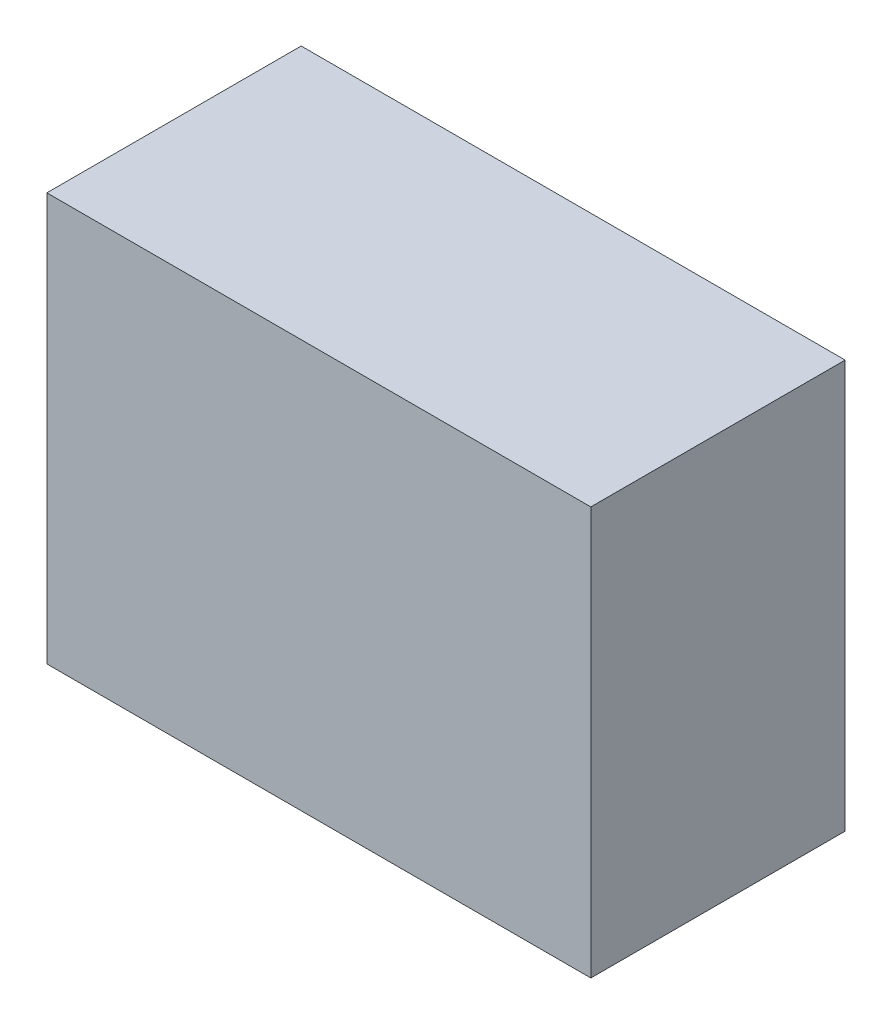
ISO-10303-21;
HEADER;
FILE_DESCRIPTION(('STEP AP214'),'2;1');
FILE_NAME('part.step','',(''),(''),'','','');
FILE_SCHEMA(('AUTOMOTIVE_DESIGN { 1 0 10303 214 1 1 1 1 }'));
ENDSEC;
DATA;
#1=APPLICATION_CONTEXT('core data for automotive mechanical design processes');
#2=APPLICATION_PROTOCOL_DEFINITION('international standard','automotive_design',2000,#1);
#3=PRODUCT_CONTEXT('',#1,'mechanical');
#4=PRODUCT('Part','Part','',(#3));
#5=PRODUCT_RELATED_PRODUCT_CATEGORY('part','',(#4));
#6=PRODUCT_DEFINITION_FORMATION('','',#4);
#7=PRODUCT_DEFINITION_CONTEXT('part definition',#1,'design');
#8=PRODUCT_DEFINITION('design','',#6,#7);
#9=PRODUCT_DEFINITION_SHAPE('','',#8);
#10=(LENGTH_UNIT() NAMED_UNIT(*) SI_UNIT(.MILLI.,.METRE.));
#11=(NAMED_UNIT(*) PLANE_ANGLE_UNIT() SI_UNIT($,.RADIAN.));
#12=(NAMED_UNIT(*) SI_UNIT($,.STERADIAN.) SOLID_ANGLE_UNIT());
#13=UNCERTAINTY_MEASURE_WITH_UNIT(LENGTH_MEASURE(1.E-05),#10,'distance_accuracy_value','');
#14=(GEOMETRIC_REPRESENTATION_CONTEXT(3) GLOBAL_UNCERTAINTY_ASSIGNED_CONTEXT((#13)) GLOBAL_UNIT_ASSIGNED_CONTEXT((#10,
#11,#12)) REPRESENTATION_CONTEXT('',''));
#15=CARTESIAN_POINT('',(0.,0.,0.));
#16=DIRECTION('',(0.,0.,1.));
#17=DIRECTION('',(1.,0.,0.));
#18=AXIS2_PLACEMENT_3D('',#15,#16,#17);
#19=CARTESIAN_POINT('',(0.,0.,0.95000064));
#20=DIRECTION('',(0.,0.,-1.));
#21=DIRECTION('',(0.,-1.,0.));
#22=AXIS2_PLACEMENT_3D('',#19,#20,#21);
#23=PLANE('',#22);
#24=DIRECTION('',(-1.,0.,0.));
#25=VECTOR('',#24,1.);
#26=CARTESIAN_POINT('',(1.016,-0.762,0.95000064));
#27=LINE('',#26,#25);
#28=CARTESIAN_POINT('',(1.016,-0.762,0.95000064));
#29=VERTEX_POINT('',#28);
#30=CARTESIAN_POINT('',(-1.016,-0.762,0.95000064));
#31=VERTEX_POINT('',#30);
#32=EDGE_CURVE('E26',#29,#31,#27,.T.);
#33=ORIENTED_EDGE('',*,*,#32,.F.);
#34=DIRECTION('',(0.,-1.,0.));
#35=VECTOR('',#34,1.);
#36=CARTESIAN_POINT('',(1.016,0.762,0.95000064));
#37=LINE('',#36,#35);
#38=CARTESIAN_POINT('',(1.016,0.762,0.95000064));
#39=VERTEX_POINT('',#38);
#40=EDGE_CURVE('E82',#39,#29,#37,.T.);
#41=ORIENTED_EDGE('',*,*,#40,.F.);
#42=DIRECTION('',(1.,0.,0.));
#43=VECTOR('',#42,1.);
#44=CARTESIAN_POINT('',(-1.016,0.762,0.95000064));
#45=LINE('',#44,#43);
#46=CARTESIAN_POINT('',(-1.016,0.762,0.95000064));
#47=VERTEX_POINT('',#46);
#48=EDGE_CURVE('E89',#47,#39,#45,.T.);
#49=ORIENTED_EDGE('',*,*,#48,.F.);
#50=DIRECTION('',(0.,1.,0.));
#51=VECTOR('',#50,1.);
#52=CARTESIAN_POINT('',(-1.016,-0.762,0.95000064));
#53=LINE('',#52,#51);
#54=EDGE_CURVE('E92',#31,#47,#53,.T.);
#55=ORIENTED_EDGE('',*,*,#54,.F.);
#56=EDGE_LOOP('',(#33,#41,#49,#55));
#57=FACE_BOUND('',#56,.T.);
#58=ADVANCED_FACE('F17',(#57),#23,.F.);
#59=CARTESIAN_POINT('',(0.,0.,0.));
#60=DIRECTION('',(0.,0.,-1.));
#61=DIRECTION('',(0.,-1.,0.));
#62=AXIS2_PLACEMENT_3D('',#59,#60,#61);
#63=PLANE('',#62);
#64=DIRECTION('',(0.,1.,0.));
#65=VECTOR('',#64,1.);
#66=CARTESIAN_POINT('',(-1.016,-0.762,0.));
#67=LINE('',#66,#65);
#68=CARTESIAN_POINT('',(-1.016,-0.762,0.));
#69=VERTEX_POINT('',#68);
#70=CARTESIAN_POINT('',(-1.016,0.762,0.));
#71=VERTEX_POINT('',#70);
#72=EDGE_CURVE('E85',#69,#71,#67,.T.);
#73=ORIENTED_EDGE('',*,*,#72,.T.);
#74=DIRECTION('',(1.,0.,0.));
#75=VECTOR('',#74,1.);
#76=CARTESIAN_POINT('',(-1.016,0.762,0.));
#77=LINE('',#76,#75);
#78=CARTESIAN_POINT('',(1.016,0.762,0.));
#79=VERTEX_POINT('',#78);
#80=EDGE_CURVE('E71',#71,#79,#77,.T.);
#81=ORIENTED_EDGE('',*,*,#80,.T.);
#82=DIRECTION('',(0.,-1.,0.));
#83=VECTOR('',#82,1.);
#84=CARTESIAN_POINT('',(1.016,0.762,0.));
#85=LINE('',#84,#83);
#86=CARTESIAN_POINT('',(1.016,-0.762,0.));
#87=VERTEX_POINT('',#86);
#88=EDGE_CURVE('E104',#79,#87,#85,.T.);
#89=ORIENTED_EDGE('',*,*,#88,.T.);
#90=DIRECTION('',(-1.,0.,0.));
#91=VECTOR('',#90,1.);
#92=CARTESIAN_POINT('',(1.016,-0.762,0.));
#93=LINE('',#92,#91);
#94=EDGE_CURVE('E11',#87,#69,#93,.T.);
#95=ORIENTED_EDGE('',*,*,#94,.T.);
#96=EDGE_LOOP('',(#73,#81,#89,#95));
#97=FACE_BOUND('',#96,.T.);
#98=ADVANCED_FACE('F19',(#97),#63,.T.);
#99=CARTESIAN_POINT('',(1.016,-0.762,0.));
#100=DIRECTION('',(0.,-1.,0.));
#101=DIRECTION('',(0.,0.,-1.));
#102=AXIS2_PLACEMENT_3D('',#99,#100,#101);
#103=PLANE('',#102);
#104=DIRECTION('',(0.,0.,1.));
#105=VECTOR('',#104,1.);
#106=CARTESIAN_POINT('',(1.016,-0.762,0.));
#107=LINE('',#106,#105);
#108=EDGE_CURVE('E102',#87,#29,#107,.T.);
#109=ORIENTED_EDGE('',*,*,#108,.T.);
#110=ORIENTED_EDGE('',*,*,#32,.T.);
#111=DIRECTION('',(0.,0.,1.));
#112=VECTOR('',#111,1.);
#113=CARTESIAN_POINT('',(-1.016,-0.762,0.));
#114=LINE('',#113,#112);
#115=EDGE_CURVE('E99',#69,#31,#114,.T.);
#116=ORIENTED_EDGE('',*,*,#115,.F.);
#117=ORIENTED_EDGE('',*,*,#94,.F.);
#118=EDGE_LOOP('',(#109,#110,#116,#117));
#119=FACE_BOUND('',#118,.T.);
#120=ADVANCED_FACE('F179',(#119),#103,.T.);
#121=CARTESIAN_POINT('',(1.016,0.762,0.));
#122=DIRECTION('',(1.,0.,0.));
#123=DIRECTION('',(0.,1.,0.));
#124=AXIS2_PLACEMENT_3D('',#121,#122,#123);
#125=PLANE('',#124);
#126=DIRECTION('',(0.,0.,1.));
#127=VECTOR('',#126,1.);
#128=CARTESIAN_POINT('',(1.016,0.762,0.));
#129=LINE('',#128,#127);
#130=EDGE_CURVE('E79',#79,#39,#129,.T.);
#131=ORIENTED_EDGE('',*,*,#130,.T.);
#132=ORIENTED_EDGE('',*,*,#40,.T.);
#133=ORIENTED_EDGE('',*,*,#108,.F.);
#134=ORIENTED_EDGE('',*,*,#88,.F.);
#135=EDGE_LOOP('',(#131,#132,#133,#134));
#136=FACE_BOUND('',#135,.T.);
#137=ADVANCED_FACE('F117',(#136),#125,.T.);
#138=CARTESIAN_POINT('',(-1.016,0.762,0.));
#139=DIRECTION('',(0.,1.,0.));
#140=DIRECTION('',(1.,0.,0.));
#141=AXIS2_PLACEMENT_3D('',#138,#139,#140);
#142=PLANE('',#141);
#143=DIRECTION('',(0.,0.,1.));
#144=VECTOR('',#143,1.);
#145=CARTESIAN_POINT('',(-1.016,0.762,0.));
#146=LINE('',#145,#144);
#147=EDGE_CURVE('E76',#71,#47,#146,.T.);
#148=ORIENTED_EDGE('',*,*,#147,.T.);
#149=ORIENTED_EDGE('',*,*,#48,.T.);
#150=ORIENTED_EDGE('',*,*,#130,.F.);
#151=ORIENTED_EDGE('',*,*,#80,.F.);
#152=EDGE_LOOP('',(#148,#149,#150,#151));
#153=FACE_BOUND('',#152,.T.);
#154=ADVANCED_FACE('F73',(#153),#142,.T.);
#155=CARTESIAN_POINT('',(-1.016,-0.762,0.));
#156=DIRECTION('',(-1.,0.,0.));
#157=DIRECTION('',(0.,0.,1.));
#158=AXIS2_PLACEMENT_3D('',#155,#156,#157);
#159=PLANE('',#158);
#160=ORIENTED_EDGE('',*,*,#115,.T.);
#161=ORIENTED_EDGE('',*,*,#54,.T.);
#162=ORIENTED_EDGE('',*,*,#147,.F.);
#163=ORIENTED_EDGE('',*,*,#72,.F.);
#164=EDGE_LOOP('',(#160,#161,#162,#163));
#165=FACE_BOUND('',#164,.T.);
#166=ADVANCED_FACE('F91',(#165),#159,.T.);
#167=CLOSED_SHELL('',(#58,#98,#120,#137,#154,#166));
#168=MANIFOLD_SOLID_BREP('B1',#167);
#169=ADVANCED_BREP_SHAPE_REPRESENTATION('',(#18,#168),#14);
#170=SHAPE_DEFINITION_REPRESENTATION(#9,#169);
ENDSEC;
END-ISO-10303-21;
